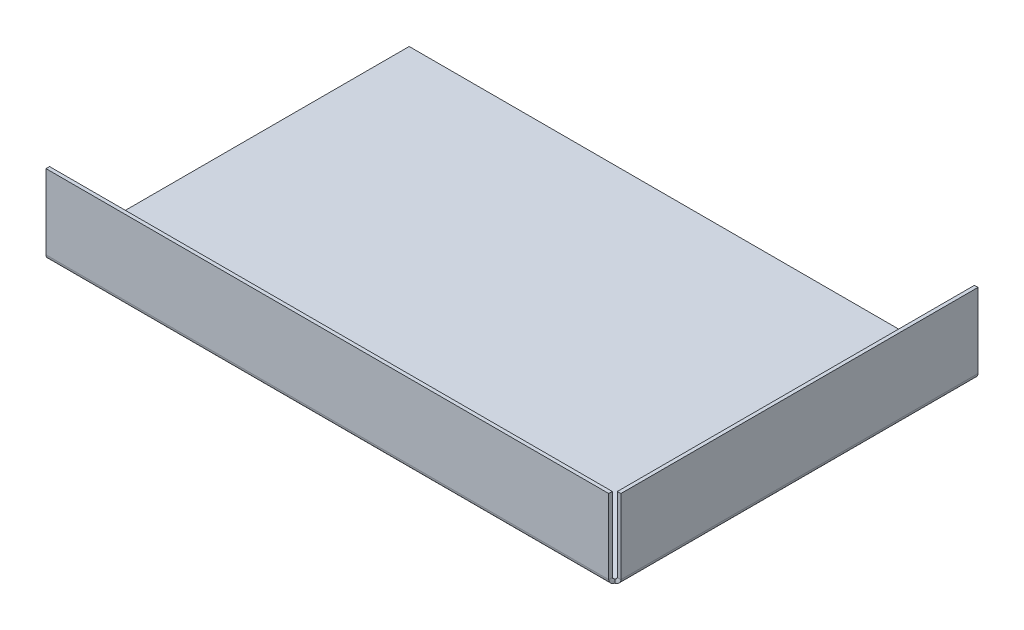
ISO-10303-21;
HEADER;
FILE_DESCRIPTION(('STEP AP214'),'2;1');
FILE_NAME('part.step','',(''),(''),'','','');
FILE_SCHEMA(('AUTOMOTIVE_DESIGN { 1 0 10303 214 1 1 1 1 }'));
ENDSEC;
DATA;
#1=APPLICATION_CONTEXT('core data for automotive mechanical design processes');
#2=APPLICATION_PROTOCOL_DEFINITION('international standard','automotive_design',2000,#1);
#3=PRODUCT_CONTEXT('',#1,'mechanical');
#4=PRODUCT('Part','Part','',(#3));
#5=PRODUCT_RELATED_PRODUCT_CATEGORY('part','',(#4));
#6=PRODUCT_DEFINITION_FORMATION('','',#4);
#7=PRODUCT_DEFINITION_CONTEXT('part definition',#1,'design');
#8=PRODUCT_DEFINITION('design','',#6,#7);
#9=PRODUCT_DEFINITION_SHAPE('','',#8);
#10=(LENGTH_UNIT() NAMED_UNIT(*) SI_UNIT(.MILLI.,.METRE.));
#11=(NAMED_UNIT(*) PLANE_ANGLE_UNIT() SI_UNIT($,.RADIAN.));
#12=(NAMED_UNIT(*) SI_UNIT($,.STERADIAN.) SOLID_ANGLE_UNIT());
#13=UNCERTAINTY_MEASURE_WITH_UNIT(LENGTH_MEASURE(1.E-05),#10,'distance_accuracy_value','');
#14=(GEOMETRIC_REPRESENTATION_CONTEXT(3) GLOBAL_UNCERTAINTY_ASSIGNED_CONTEXT((#13)) GLOBAL_UNIT_ASSIGNED_CONTEXT((#10,
#11,#12)) REPRESENTATION_CONTEXT('',''));
#15=CARTESIAN_POINT('',(0.,0.,0.));
#16=DIRECTION('',(0.,0.,1.));
#17=DIRECTION('',(1.,0.,0.));
#18=AXIS2_PLACEMENT_3D('',#15,#16,#17);
#19=CARTESIAN_POINT('',(0.,0.762,-76.5167255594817));
#20=DIRECTION('',(1.,0.,0.));
#21=DIRECTION('',(0.,0.,-1.));
#22=AXIS2_PLACEMENT_3D('',#19,#20,#21);
#23=PLANE('',#22);
#24=DIRECTION('',(0.,0.,1.));
#25=VECTOR('',#24,1.);
#26=CARTESIAN_POINT('',(0.,0.,-76.5167255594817));
#27=LINE('',#26,#25);
#28=CARTESIAN_POINT('',(0.,0.,-76.5167255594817));
#29=VERTEX_POINT('',#28);
#30=CARTESIAN_POINT('',(0.,0.,0.));
#31=VERTEX_POINT('',#30);
#32=EDGE_CURVE('E208',#29,#31,#27,.T.);
#33=ORIENTED_EDGE('',*,*,#32,.T.);
#34=DIRECTION('',(0.,-1.,0.));
#35=VECTOR('',#34,1.);
#36=CARTESIAN_POINT('',(0.,0.762,0.));
#37=LINE('',#36,#35);
#38=CARTESIAN_POINT('',(0.,0.762,0.));
#39=VERTEX_POINT('',#38);
#40=EDGE_CURVE('E11',#39,#31,#37,.T.);
#41=ORIENTED_EDGE('',*,*,#40,.F.);
#42=DIRECTION('',(0.,0.,1.));
#43=VECTOR('',#42,1.);
#44=CARTESIAN_POINT('',(0.,0.762,-76.5167255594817));
#45=LINE('',#44,#43);
#46=CARTESIAN_POINT('',(0.,0.762,-76.5167255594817));
#47=VERTEX_POINT('',#46);
#48=EDGE_CURVE('E221',#47,#39,#45,.T.);
#49=ORIENTED_EDGE('',*,*,#48,.F.);
#50=DIRECTION('',(0.,-1.,0.));
#51=VECTOR('',#50,1.);
#52=CARTESIAN_POINT('',(0.,0.762,-76.5167255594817));
#53=LINE('',#52,#51);
#54=EDGE_CURVE('E227',#47,#29,#53,.T.);
#55=ORIENTED_EDGE('',*,*,#54,.T.);
#56=EDGE_LOOP('',(#33,#41,#49,#55));
#57=FACE_BOUND('',#56,.T.);
#58=ADVANCED_FACE('F28',(#57),#23,.F.);
#59=CARTESIAN_POINT('',(0.,0.762,-76.5167255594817));
#60=DIRECTION('',(0.,0.,1.));
#61=DIRECTION('',(1.,0.,0.));
#62=AXIS2_PLACEMENT_3D('',#59,#60,#61);
#63=PLANE('',#62);
#64=DIRECTION('',(-1.,0.,0.));
#65=VECTOR('',#64,1.);
#66=CARTESIAN_POINT('',(0.,0.,-76.5167255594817));
#67=LINE('',#66,#65);
#68=CARTESIAN_POINT('',(120.423583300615,0.,-76.5167255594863));
#69=VERTEX_POINT('',#68);
#70=EDGE_CURVE('E219',#69,#29,#67,.T.);
#71=ORIENTED_EDGE('',*,*,#70,.T.);
#72=ORIENTED_EDGE('',*,*,#54,.F.);
#73=DIRECTION('',(-1.,0.,0.));
#74=VECTOR('',#73,1.);
#75=CARTESIAN_POINT('',(0.,0.762,-76.5167255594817));
#76=LINE('',#75,#74);
#77=CARTESIAN_POINT('',(120.423583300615,0.762,-76.5167255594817));
#78=VERTEX_POINT('',#77);
#79=EDGE_CURVE('E42',#78,#47,#76,.T.);
#80=ORIENTED_EDGE('',*,*,#79,.F.);
#81=DIRECTION('',(0.,-1.,0.));
#82=VECTOR('',#81,1.);
#83=CARTESIAN_POINT('',(120.423583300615,0.762,-76.5167255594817));
#84=LINE('',#83,#82);
#85=EDGE_CURVE('E230',#78,#69,#84,.T.);
#86=ORIENTED_EDGE('',*,*,#85,.T.);
#87=EDGE_LOOP('',(#71,#72,#80,#86));
#88=FACE_BOUND('',#87,.T.);
#89=ADVANCED_FACE('F265',(#88),#63,.F.);
#90=CARTESIAN_POINT('',(0.,0.762,0.));
#91=DIRECTION('',(0.,1.,0.));
#92=DIRECTION('',(0.,0.,1.));
#93=AXIS2_PLACEMENT_3D('',#90,#91,#92);
#94=PLANE('',#93);
#95=ORIENTED_EDGE('',*,*,#48,.T.);
#96=DIRECTION('',(1.,0.,0.));
#97=VECTOR('',#96,1.);
#98=CARTESIAN_POINT('',(0.,0.762,0.));
#99=LINE('',#98,#97);
#100=CARTESIAN_POINT('',(120.423583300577,0.762,0.));
#101=VERTEX_POINT('',#100);
#102=EDGE_CURVE('E223',#39,#101,#99,.T.);
#103=ORIENTED_EDGE('',*,*,#102,.T.);
#104=DIRECTION('',(0.,0.,-1.));
#105=VECTOR('',#104,1.);
#106=CARTESIAN_POINT('',(120.423583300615,0.762,-76.5167255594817));
#107=LINE('',#106,#105);
#108=EDGE_CURVE('E47',#101,#78,#107,.T.);
#109=ORIENTED_EDGE('',*,*,#108,.T.);
#110=ORIENTED_EDGE('',*,*,#79,.T.);
#111=EDGE_LOOP('',(#95,#103,#109,#110));
#112=FACE_BOUND('',#111,.T.);
#113=ADVANCED_FACE('F269',(#112),#94,.T.);
#114=CARTESIAN_POINT('',(0.,0.,0.));
#115=DIRECTION('',(0.,1.,0.));
#116=DIRECTION('',(0.,0.,1.));
#117=AXIS2_PLACEMENT_3D('',#114,#115,#116);
#118=PLANE('',#117);
#119=ORIENTED_EDGE('',*,*,#32,.F.);
#120=ORIENTED_EDGE('',*,*,#70,.F.);
#121=DIRECTION('',(0.,0.,-1.));
#122=VECTOR('',#121,1.);
#123=CARTESIAN_POINT('',(120.423583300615,0.,-76.5167255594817));
#124=LINE('',#123,#122);
#125=CARTESIAN_POINT('',(120.423583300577,0.,0.));
#126=VERTEX_POINT('',#125);
#127=EDGE_CURVE('E216',#126,#69,#124,.T.);
#128=ORIENTED_EDGE('',*,*,#127,.F.);
#129=DIRECTION('',(1.,0.,0.));
#130=VECTOR('',#129,1.);
#131=CARTESIAN_POINT('',(0.,0.,0.));
#132=LINE('',#131,#130);
#133=EDGE_CURVE('E213',#31,#126,#132,.T.);
#134=ORIENTED_EDGE('',*,*,#133,.F.);
#135=EDGE_LOOP('',(#119,#120,#128,#134));
#136=FACE_BOUND('',#135,.T.);
#137=ADVANCED_FACE('F246',(#136),#118,.F.);
#138=CARTESIAN_POINT('',(120.677583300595,16.9447415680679,-76.5167255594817));
#139=DIRECTION('',(1.23489671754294E-12,-1.,0.));
#140=DIRECTION('',(0.,0.,1.));
#141=AXIS2_PLACEMENT_3D('',#138,#139,#140);
#142=PLANE('',#141);
#143=DIRECTION('',(-1.,-1.23489671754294E-12,0.));
#144=VECTOR('',#143,1.);
#145=CARTESIAN_POINT('',(120.677583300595,16.9447415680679,-0.284815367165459));
#146=LINE('',#145,#144);
#147=CARTESIAN_POINT('',(120.677583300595,16.9447415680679,-0.284815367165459));
#148=VERTEX_POINT('',#147);
#149=CARTESIAN_POINT('',(121.439583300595,16.9447415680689,-0.284815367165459));
#150=VERTEX_POINT('',#149);
#151=EDGE_CURVE('E205',#148,#150,#146,.F.);
#152=ORIENTED_EDGE('',*,*,#151,.T.);
#153=DIRECTION('',(0.,0.,1.));
#154=VECTOR('',#153,1.);
#155=CARTESIAN_POINT('',(121.439583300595,16.9447415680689,-76.5167255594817));
#156=LINE('',#155,#154);
#157=CARTESIAN_POINT('',(121.439583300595,16.9447415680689,-76.5167255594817));
#158=VERTEX_POINT('',#157);
#159=EDGE_CURVE('E187',#158,#150,#156,.T.);
#160=ORIENTED_EDGE('',*,*,#159,.F.);
#161=DIRECTION('',(-1.,-1.23489671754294E-12,0.));
#162=VECTOR('',#161,1.);
#163=CARTESIAN_POINT('',(120.677583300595,16.9447415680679,-76.5167255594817));
#164=LINE('',#163,#162);
#165=CARTESIAN_POINT('',(120.677583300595,16.9447415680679,-76.5167255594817));
#166=VERTEX_POINT('',#165);
#167=EDGE_CURVE('E202',#166,#158,#164,.F.);
#168=ORIENTED_EDGE('',*,*,#167,.F.);
#169=DIRECTION('',(0.,0.,1.));
#170=VECTOR('',#169,1.);
#171=CARTESIAN_POINT('',(120.677583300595,16.9447415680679,-76.5167255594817));
#172=LINE('',#171,#170);
#173=EDGE_CURVE('E176',#166,#148,#172,.T.);
#174=ORIENTED_EDGE('',*,*,#173,.T.);
#175=EDGE_LOOP('',(#152,#160,#168,#174));
#176=FACE_BOUND('',#175,.T.);
#177=ADVANCED_FACE('F306',(#176),#142,.F.);
#178=CARTESIAN_POINT('',(120.677583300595,16.9447415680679,-76.5167255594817));
#179=DIRECTION('',(0.,0.,-1.));
#180=DIRECTION('',(1.23489671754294E-12,-1.,0.));
#181=AXIS2_PLACEMENT_3D('',#178,#179,#180);
#182=PLANE('',#181);
#183=ORIENTED_EDGE('',*,*,#167,.T.);
#184=DIRECTION('',(1.23489671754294E-12,-1.,0.));
#185=VECTOR('',#184,1.);
#186=CARTESIAN_POINT('',(121.439583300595,16.9447415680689,-76.5167255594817));
#187=LINE('',#186,#185);
#188=CARTESIAN_POINT('',(121.439583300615,1.01600000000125,-76.5167255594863));
#189=VERTEX_POINT('',#188);
#190=EDGE_CURVE('E192',#158,#189,#187,.T.);
#191=ORIENTED_EDGE('',*,*,#190,.T.);
#192=DIRECTION('',(-1.,-1.23489671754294E-12,0.));
#193=VECTOR('',#192,1.);
#194=CARTESIAN_POINT('',(120.677583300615,1.01600000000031,-76.516725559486));
#195=LINE('',#194,#193);
#196=CARTESIAN_POINT('',(120.677583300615,1.01600000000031,-76.5167255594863));
#197=VERTEX_POINT('',#196);
#198=EDGE_CURVE('E199',#197,#189,#195,.F.);
#199=ORIENTED_EDGE('',*,*,#198,.F.);
#200=DIRECTION('',(1.23489671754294E-12,-1.,0.));
#201=VECTOR('',#200,1.);
#202=CARTESIAN_POINT('',(120.677583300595,16.9447415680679,-76.5167255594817));
#203=LINE('',#202,#201);
#204=EDGE_CURVE('E181',#166,#197,#203,.T.);
#205=ORIENTED_EDGE('',*,*,#204,.F.);
#206=EDGE_LOOP('',(#183,#191,#199,#205));
#207=FACE_BOUND('',#206,.T.);
#208=ADVANCED_FACE('F309',(#207),#182,.T.);
#209=CARTESIAN_POINT('',(120.677583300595,16.9447415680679,-0.284815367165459));
#210=DIRECTION('',(0.,0.,-1.));
#211=DIRECTION('',(1.23489671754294E-12,-1.,0.));
#212=AXIS2_PLACEMENT_3D('',#209,#210,#211);
#213=PLANE('',#212);
#214=DIRECTION('',(1.23489671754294E-12,-1.,0.));
#215=VECTOR('',#214,1.);
#216=CARTESIAN_POINT('',(120.677583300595,16.9447415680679,-0.284815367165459));
#217=LINE('',#216,#215);
#218=CARTESIAN_POINT('',(120.677583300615,1.01600000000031,-0.284815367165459));
#219=VERTEX_POINT('',#218);
#220=EDGE_CURVE('E180',#219,#148,#217,.F.);
#221=ORIENTED_EDGE('',*,*,#220,.F.);
#222=DIRECTION('',(-1.,-1.23489671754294E-12,0.));
#223=VECTOR('',#222,1.);
#224=CARTESIAN_POINT('',(120.677583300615,1.01600000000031,-0.284815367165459));
#225=LINE('',#224,#223);
#226=CARTESIAN_POINT('',(121.439583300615,1.01600000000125,-0.284815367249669));
#227=VERTEX_POINT('',#226);
#228=EDGE_CURVE('E198',#219,#227,#225,.F.);
#229=ORIENTED_EDGE('',*,*,#228,.T.);
#230=DIRECTION('',(1.23489671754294E-12,-1.,0.));
#231=VECTOR('',#230,1.);
#232=CARTESIAN_POINT('',(121.439583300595,16.9447415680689,-0.284815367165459));
#233=LINE('',#232,#231);
#234=EDGE_CURVE('E191',#227,#150,#233,.F.);
#235=ORIENTED_EDGE('',*,*,#234,.T.);
#236=ORIENTED_EDGE('',*,*,#151,.F.);
#237=EDGE_LOOP('',(#221,#229,#235,#236));
#238=FACE_BOUND('',#237,.T.);
#239=ADVANCED_FACE('F257',(#238),#213,.F.);
#240=CARTESIAN_POINT('',(121.439583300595,16.9447415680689,-76.5167255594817));
#241=DIRECTION('',(-1.,-1.23489671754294E-12,0.));
#242=DIRECTION('',(1.23489671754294E-12,-1.,0.));
#243=AXIS2_PLACEMENT_3D('',#240,#241,#242);
#244=PLANE('',#243);
#245=DIRECTION('',(0.,0.,1.));
#246=VECTOR('',#245,1.);
#247=CARTESIAN_POINT('',(121.439583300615,1.01600000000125,-76.5167255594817));
#248=LINE('',#247,#246);
#249=EDGE_CURVE('E188',#189,#227,#248,.T.);
#250=ORIENTED_EDGE('',*,*,#249,.F.);
#251=ORIENTED_EDGE('',*,*,#190,.F.);
#252=ORIENTED_EDGE('',*,*,#159,.T.);
#253=ORIENTED_EDGE('',*,*,#234,.F.);
#254=EDGE_LOOP('',(#250,#251,#252,#253));
#255=FACE_BOUND('',#254,.T.);
#256=ADVANCED_FACE('F252',(#255),#244,.F.);
#257=CARTESIAN_POINT('',(120.677583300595,16.9447415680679,-76.5167255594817));
#258=DIRECTION('',(-1.,-1.23489671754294E-12,0.));
#259=DIRECTION('',(1.23489671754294E-12,-1.,0.));
#260=AXIS2_PLACEMENT_3D('',#257,#258,#259);
#261=PLANE('',#260);
#262=DIRECTION('',(0.,0.,1.));
#263=VECTOR('',#262,1.);
#264=CARTESIAN_POINT('',(120.677583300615,1.01600000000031,-76.5167255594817));
#265=LINE('',#264,#263);
#266=EDGE_CURVE('E177',#197,#219,#265,.T.);
#267=ORIENTED_EDGE('',*,*,#266,.T.);
#268=ORIENTED_EDGE('',*,*,#220,.T.);
#269=ORIENTED_EDGE('',*,*,#173,.F.);
#270=ORIENTED_EDGE('',*,*,#204,.T.);
#271=EDGE_LOOP('',(#267,#268,#269,#270));
#272=FACE_BOUND('',#271,.T.);
#273=ADVANCED_FACE('F318',(#272),#261,.T.);
#274=CARTESIAN_POINT('',(120.423583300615,1.016,-76.5167255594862));
#275=DIRECTION('',(-2.73267207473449E-13,0.,1.));
#276=DIRECTION('',(1.,0.,2.73267207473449E-13));
#277=AXIS2_PLACEMENT_3D('',#274,#275,#276);
#278=PLANE('',#277);
#279=ORIENTED_EDGE('',*,*,#198,.T.);
#280=CARTESIAN_POINT('',(120.423583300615,1.016,-76.5167255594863));
#281=DIRECTION('',(0.,0.,1.));
#282=DIRECTION('',(1.,0.,0.));
#283=AXIS2_PLACEMENT_3D('',#280,#281,#282);
#284=CIRCLE('',#283,1.016);
#285=EDGE_CURVE('E171',#189,#69,#284,.F.);
#286=ORIENTED_EDGE('',*,*,#285,.T.);
#287=ORIENTED_EDGE('',*,*,#85,.F.);
#288=CARTESIAN_POINT('',(120.423583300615,1.016,-76.5167255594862));
#289=DIRECTION('',(2.73267207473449E-13,0.,-1.));
#290=DIRECTION('',(-1.,0.,-2.73267207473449E-13));
#291=AXIS2_PLACEMENT_3D('',#288,#289,#290);
#292=CIRCLE('',#291,0.254);
#293=EDGE_CURVE('E165',#197,#78,#292,.T.);
#294=ORIENTED_EDGE('',*,*,#293,.F.);
#295=EDGE_LOOP('',(#279,#286,#287,#294));
#296=FACE_BOUND('',#295,.T.);
#297=ADVANCED_FACE('F263',(#296),#278,.F.);
#298=CARTESIAN_POINT('',(120.169583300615,1.016,0.284815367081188));
#299=CARTESIAN_POINT('',(119.915583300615,1.016,0.284815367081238));
#300=CARTESIAN_POINT('',(119.661583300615,1.016,0.284815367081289));
#301=CARTESIAN_POINT('',(119.407583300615,1.016,0.28481536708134));
#302=CARTESIAN_POINT('',(120.169583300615,0.508,0.284815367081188));
#303=CARTESIAN_POINT('',(119.915583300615,0.,0.284815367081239));
#304=CARTESIAN_POINT('',(119.661583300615,-0.508,0.284815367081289));
#305=CARTESIAN_POINT('',(119.407583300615,-1.016,0.28481536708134));
#306=CARTESIAN_POINT('',(120.677583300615,0.508,-0.28481536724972));
#307=CARTESIAN_POINT('',(120.931583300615,0.,-0.28481536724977));
#308=CARTESIAN_POINT('',(121.185583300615,-0.508,-0.284815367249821));
#309=CARTESIAN_POINT('',(121.439583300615,-1.016,-0.284815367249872));
#310=CARTESIAN_POINT('',(120.677583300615,1.016,-0.28481536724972));
#311=CARTESIAN_POINT('',(120.931583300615,1.016,-0.28481536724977));
#312=CARTESIAN_POINT('',(121.185583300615,1.016,-0.284815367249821));
#313=CARTESIAN_POINT('',(121.439583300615,1.016,-0.284815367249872));
#314=CARTESIAN_POINT('',(120.677583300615,1.524,-0.28481536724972));
#315=CARTESIAN_POINT('',(120.931583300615,2.032,-0.28481536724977));
#316=CARTESIAN_POINT('',(121.185583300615,2.54,-0.284815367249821));
#317=CARTESIAN_POINT('',(121.439583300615,3.048,-0.284815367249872));
#318=CARTESIAN_POINT('',(120.169583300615,1.524,0.284815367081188));
#319=CARTESIAN_POINT('',(119.915583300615,2.032,0.284815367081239));
#320=CARTESIAN_POINT('',(119.661583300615,2.54,0.284815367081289));
#321=CARTESIAN_POINT('',(119.407583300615,3.048,0.28481536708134));
#322=CARTESIAN_POINT('',(120.169583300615,1.016,0.284815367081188));
#323=CARTESIAN_POINT('',(119.915583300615,1.016,0.284815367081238));
#324=CARTESIAN_POINT('',(119.661583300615,1.016,0.284815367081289));
#325=CARTESIAN_POINT('',(119.407583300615,1.016,0.28481536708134));
#326=(BOUNDED_SURFACE() B_SPLINE_SURFACE(3,3,((#298,#299,#300,#301),(#302,#303,#304,#305),(#306,
#307,#308,#309),(#310,#311,#312,#313),(#314,#315,#316,#317),(#318,#319,#320,#321),(#322,#323,
#324,#325)),.UNSPECIFIED.,.T.,.F.,.F.) B_SPLINE_SURFACE_WITH_KNOTS((4,3,4),(4,4),(0.,0.5,1.),
(0.,1.),.UNSPECIFIED.) GEOMETRIC_REPRESENTATION_ITEM() RATIONAL_B_SPLINE_SURFACE(((1.,1.,1.,1.),
(0.333333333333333,0.333333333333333,0.333333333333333,0.333333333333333),(0.333333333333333,
0.333333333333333,0.333333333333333,0.333333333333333),(1.,1.,1.,1.),(0.333333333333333,
0.333333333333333,0.333333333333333,0.333333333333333),(0.333333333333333,0.333333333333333,
0.333333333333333,0.333333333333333),(1.,1.,1.,1.))) REPRESENTATION_ITEM('') SURFACE());
#327=CARTESIAN_POINT('',(120.423583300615,1.016,-8.42659275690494E-11));
#328=DIRECTION('',(0.746327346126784,0.,0.665579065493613));
#329=DIRECTION('',(-0.665579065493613,0.,0.746327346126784));
#330=AXIS2_PLACEMENT_3D('',#327,#328,#329);
#331=ELLIPSE('',#330,0.381622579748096,0.254);
#332=EDGE_CURVE('E168',#101,#219,#331,.T.);
#333=DIRECTION('',(0.,-1.,0.));
#334=VECTOR('',#333,1.);
#335=CARTESIAN_POINT('',(120.423583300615,0.762,0.));
#336=LINE('',#335,#334);
#337=EDGE_CURVE('E35',#101,#126,#336,.T.);
#338=CARTESIAN_POINT('',(120.423583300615,1.016,-8.42659275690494E-11));
#339=DIRECTION('',(0.269924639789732,0.,0.962881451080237));
#340=DIRECTION('',(-0.962881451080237,0.,0.269924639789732));
#341=AXIS2_PLACEMENT_3D('',#338,#339,#340);
#342=ELLIPSE('',#341,1.05516623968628,1.016);
#343=EDGE_CURVE('E174',#126,#227,#342,.T.);
#344=ORIENTED_EDGE('',*,*,#332,.F.);
#345=ORIENTED_EDGE('',*,*,#337,.T.);
#346=ORIENTED_EDGE('',*,*,#343,.T.);
#347=ORIENTED_EDGE('',*,*,#228,.F.);
#348=EDGE_LOOP('',(#344,#345,#346,#347));
#349=FACE_BOUND('',#348,.T.);
#350=ADVANCED_FACE('F235',(#349),#326,.F.);
#351=CARTESIAN_POINT('',(120.423583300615,1.016,-678.634642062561));
#352=DIRECTION('',(0.,0.,1.));
#353=DIRECTION('',(1.,0.,0.));
#354=AXIS2_PLACEMENT_3D('',#351,#352,#353);
#355=CYLINDRICAL_SURFACE('',#354,1.016);
#356=ORIENTED_EDGE('',*,*,#127,.T.);
#357=ORIENTED_EDGE('',*,*,#285,.F.);
#358=ORIENTED_EDGE('',*,*,#249,.T.);
#359=ORIENTED_EDGE('',*,*,#343,.F.);
#360=EDGE_LOOP('',(#356,#357,#358,#359));
#361=FACE_BOUND('',#360,.T.);
#362=ADVANCED_FACE('F248',(#361),#355,.T.);
#363=CARTESIAN_POINT('',(120.423583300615,1.016,-678.634642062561));
#364=DIRECTION('',(0.,0.,1.));
#365=DIRECTION('',(1.,0.,0.));
#366=AXIS2_PLACEMENT_3D('',#363,#364,#365);
#367=CYLINDRICAL_SURFACE('',#366,0.254);
#368=ORIENTED_EDGE('',*,*,#108,.F.);
#369=ORIENTED_EDGE('',*,*,#332,.T.);
#370=ORIENTED_EDGE('',*,*,#266,.F.);
#371=ORIENTED_EDGE('',*,*,#293,.T.);
#372=EDGE_LOOP('',(#368,#369,#370,#371));
#373=FACE_BOUND('',#372,.T.);
#374=ADVANCED_FACE('F260',(#373),#367,.F.);
#375=CARTESIAN_POINT('',(0.,16.9447415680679,0.253999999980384));
#376=DIRECTION('',(1.,0.,0.));
#377=DIRECTION('',(0.,-1.,1.23489671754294E-12));
#378=AXIS2_PLACEMENT_3D('',#375,#376,#377);
#379=PLANE('',#378);
#380=DIRECTION('',(0.,-1.23489671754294E-12,-1.));
#381=VECTOR('',#380,1.);
#382=CARTESIAN_POINT('',(0.,1.01600000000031,0.254000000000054));
#383=LINE('',#382,#381);
#384=CARTESIAN_POINT('',(0.,1.01600000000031,0.254000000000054));
#385=VERTEX_POINT('',#384);
#386=CARTESIAN_POINT('',(0.,1.01600000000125,1.01600000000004));
#387=VERTEX_POINT('',#386);
#388=EDGE_CURVE('E279',#385,#387,#383,.F.);
#389=ORIENTED_EDGE('',*,*,#388,.T.);
#390=DIRECTION('',(0.,-1.,1.23489671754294E-12));
#391=VECTOR('',#390,1.);
#392=CARTESIAN_POINT('',(0.,16.9447415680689,1.01599999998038));
#393=LINE('',#392,#391);
#394=CARTESIAN_POINT('',(0.,16.9447415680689,1.01599999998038));
#395=VERTEX_POINT('',#394);
#396=EDGE_CURVE('E145',#387,#395,#393,.F.);
#397=ORIENTED_EDGE('',*,*,#396,.T.);
#398=DIRECTION('',(0.,-1.23489671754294E-12,-1.));
#399=VECTOR('',#398,1.);
#400=CARTESIAN_POINT('',(0.,16.9447415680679,0.253999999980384));
#401=LINE('',#400,#399);
#402=CARTESIAN_POINT('',(0.,16.9447415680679,0.253999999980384));
#403=VERTEX_POINT('',#402);
#404=EDGE_CURVE('E139',#403,#395,#401,.F.);
#405=ORIENTED_EDGE('',*,*,#404,.F.);
#406=DIRECTION('',(0.,-1.,1.23489671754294E-12));
#407=VECTOR('',#406,1.);
#408=CARTESIAN_POINT('',(0.,16.9447415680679,0.253999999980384));
#409=LINE('',#408,#407);
#410=EDGE_CURVE('E150',#385,#403,#409,.F.);
#411=ORIENTED_EDGE('',*,*,#410,.F.);
#412=EDGE_LOOP('',(#389,#397,#405,#411));
#413=FACE_BOUND('',#412,.T.);
#414=ADVANCED_FACE('F283',(#413),#379,.F.);
#415=CARTESIAN_POINT('',(722.54149980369,16.9447415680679,0.25399999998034));
#416=DIRECTION('',(0.,-1.,1.23489671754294E-12));
#417=DIRECTION('',(-1.,0.,0.));
#418=AXIS2_PLACEMENT_3D('',#415,#416,#417);
#419=PLANE('',#418);
#420=ORIENTED_EDGE('',*,*,#404,.T.);
#421=DIRECTION('',(-1.,0.,0.));
#422=VECTOR('',#421,1.);
#423=CARTESIAN_POINT('',(722.54149980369,16.9447415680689,1.01599999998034));
#424=LINE('',#423,#422);
#425=CARTESIAN_POINT('',(120.138767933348,16.9447415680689,1.01599999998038));
#426=VERTEX_POINT('',#425);
#427=EDGE_CURVE('E121',#426,#395,#424,.T.);
#428=ORIENTED_EDGE('',*,*,#427,.F.);
#429=DIRECTION('',(0.,-1.23489671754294E-12,-1.));
#430=VECTOR('',#429,1.);
#431=CARTESIAN_POINT('',(120.138767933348,16.9447415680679,0.253999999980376));
#432=LINE('',#431,#430);
#433=CARTESIAN_POINT('',(120.138767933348,16.9447415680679,0.253999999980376));
#434=VERTEX_POINT('',#433);
#435=EDGE_CURVE('E127',#434,#426,#432,.F.);
#436=ORIENTED_EDGE('',*,*,#435,.F.);
#437=DIRECTION('',(-1.,0.,0.));
#438=VECTOR('',#437,1.);
#439=CARTESIAN_POINT('',(722.54149980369,16.9447415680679,0.25399999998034));
#440=LINE('',#439,#438);
#441=EDGE_CURVE('E135',#434,#403,#440,.T.);
#442=ORIENTED_EDGE('',*,*,#441,.T.);
#443=EDGE_LOOP('',(#420,#428,#436,#442));
#444=FACE_BOUND('',#443,.T.);
#445=ADVANCED_FACE('F137',(#444),#419,.F.);
#446=CARTESIAN_POINT('',(120.138767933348,16.9447415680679,0.253999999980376));
#447=DIRECTION('',(1.,0.,0.));
#448=DIRECTION('',(0.,-1.,1.23489671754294E-12));
#449=AXIS2_PLACEMENT_3D('',#446,#447,#448);
#450=PLANE('',#449);
#451=DIRECTION('',(0.,-1.,1.23489671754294E-12));
#452=VECTOR('',#451,1.);
#453=CARTESIAN_POINT('',(120.138767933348,16.9447415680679,0.253999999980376));
#454=LINE('',#453,#452);
#455=CARTESIAN_POINT('',(120.13876793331,1.01600000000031,0.254000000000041));
#456=VERTEX_POINT('',#455);
#457=EDGE_CURVE('E132',#434,#456,#454,.T.);
#458=ORIENTED_EDGE('',*,*,#457,.F.);
#459=ORIENTED_EDGE('',*,*,#435,.T.);
#460=DIRECTION('',(0.,-1.,1.23489671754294E-12));
#461=VECTOR('',#460,1.);
#462=CARTESIAN_POINT('',(120.138767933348,16.9447415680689,1.01599999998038));
#463=LINE('',#462,#461);
#464=CARTESIAN_POINT('',(120.13876793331,1.01600000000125,1.01600000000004));
#465=VERTEX_POINT('',#464);
#466=EDGE_CURVE('E116',#426,#465,#463,.T.);
#467=ORIENTED_EDGE('',*,*,#466,.T.);
#468=DIRECTION('',(0.,-1.23489671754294E-12,-1.));
#469=VECTOR('',#468,1.);
#470=CARTESIAN_POINT('',(120.138767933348,1.01600000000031,0.254000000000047));
#471=LINE('',#470,#469);
#472=EDGE_CURVE('E153',#456,#465,#471,.F.);
#473=ORIENTED_EDGE('',*,*,#472,.F.);
#474=EDGE_LOOP('',(#458,#459,#467,#473));
#475=FACE_BOUND('',#474,.T.);
#476=ADVANCED_FACE('F130',(#475),#450,.T.);
#477=CARTESIAN_POINT('',(722.54149980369,16.9447415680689,1.01599999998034));
#478=DIRECTION('',(0.,-1.23489671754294E-12,-1.));
#479=DIRECTION('',(0.,-1.,1.23489671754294E-12));
#480=AXIS2_PLACEMENT_3D('',#477,#478,#479);
#481=PLANE('',#480);
#482=ORIENTED_EDGE('',*,*,#427,.T.);
#483=ORIENTED_EDGE('',*,*,#396,.F.);
#484=DIRECTION('',(-1.,0.,0.));
#485=VECTOR('',#484,1.);
#486=CARTESIAN_POINT('',(722.54149980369,1.01600000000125,1.01600000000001));
#487=LINE('',#486,#485);
#488=EDGE_CURVE('E124',#465,#387,#487,.T.);
#489=ORIENTED_EDGE('',*,*,#488,.F.);
#490=ORIENTED_EDGE('',*,*,#466,.F.);
#491=EDGE_LOOP('',(#482,#483,#489,#490));
#492=FACE_BOUND('',#491,.T.);
#493=ADVANCED_FACE('F118',(#492),#481,.F.);
#494=CARTESIAN_POINT('',(722.54149980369,16.9447415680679,0.25399999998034));
#495=DIRECTION('',(0.,-1.23489671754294E-12,-1.));
#496=DIRECTION('',(0.,-1.,1.23489671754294E-12));
#497=AXIS2_PLACEMENT_3D('',#494,#495,#496);
#498=PLANE('',#497);
#499=ORIENTED_EDGE('',*,*,#441,.F.);
#500=ORIENTED_EDGE('',*,*,#457,.T.);
#501=DIRECTION('',(-1.,0.,0.));
#502=VECTOR('',#501,1.);
#503=CARTESIAN_POINT('',(722.54149980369,1.01600000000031,0.25400000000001));
#504=LINE('',#503,#502);
#505=EDGE_CURVE('E142',#456,#385,#504,.T.);
#506=ORIENTED_EDGE('',*,*,#505,.T.);
#507=ORIENTED_EDGE('',*,*,#410,.T.);
#508=EDGE_LOOP('',(#499,#500,#506,#507));
#509=FACE_BOUND('',#508,.T.);
#510=ADVANCED_FACE('F276',(#509),#498,.T.);
#511=CARTESIAN_POINT('',(120.13876793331,1.016,0.254000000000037));
#512=CARTESIAN_POINT('',(120.13876793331,1.016,0.508000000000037));
#513=CARTESIAN_POINT('',(120.13876793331,1.016,0.762000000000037));
#514=CARTESIAN_POINT('',(120.13876793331,1.016,1.01600000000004));
#515=CARTESIAN_POINT('',(120.13876793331,0.508,0.254000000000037));
#516=CARTESIAN_POINT('',(120.13876793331,0.,0.508000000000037));
#517=CARTESIAN_POINT('',(120.13876793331,-0.508,0.762000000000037));
#518=CARTESIAN_POINT('',(120.13876793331,-1.016,1.01600000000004));
#519=CARTESIAN_POINT('',(120.708398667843,0.508,-0.253999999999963));
#520=CARTESIAN_POINT('',(120.708398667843,0.,-0.507999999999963));
#521=CARTESIAN_POINT('',(120.708398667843,-0.508,-0.761999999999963));
#522=CARTESIAN_POINT('',(120.708398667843,-1.016,-1.01599999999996));
#523=CARTESIAN_POINT('',(120.708398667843,1.016,-0.253999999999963));
#524=CARTESIAN_POINT('',(120.708398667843,1.016,-0.507999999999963));
#525=CARTESIAN_POINT('',(120.708398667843,1.016,-0.761999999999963));
#526=CARTESIAN_POINT('',(120.708398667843,1.016,-1.01599999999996));
#527=CARTESIAN_POINT('',(120.708398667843,1.524,-0.253999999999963));
#528=CARTESIAN_POINT('',(120.708398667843,2.032,-0.507999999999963));
#529=CARTESIAN_POINT('',(120.708398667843,2.54,-0.761999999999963));
#530=CARTESIAN_POINT('',(120.708398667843,3.048,-1.01599999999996));
#531=CARTESIAN_POINT('',(120.13876793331,1.524,0.254000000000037));
#532=CARTESIAN_POINT('',(120.13876793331,2.032,0.508000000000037));
#533=CARTESIAN_POINT('',(120.13876793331,2.54,0.762000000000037));
#534=CARTESIAN_POINT('',(120.13876793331,3.048,1.01600000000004));
#535=CARTESIAN_POINT('',(120.13876793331,1.016,0.254000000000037));
#536=CARTESIAN_POINT('',(120.13876793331,1.016,0.508000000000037));
#537=CARTESIAN_POINT('',(120.13876793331,1.016,0.762000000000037));
#538=CARTESIAN_POINT('',(120.13876793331,1.016,1.01600000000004));
#539=(BOUNDED_SURFACE() B_SPLINE_SURFACE(3,3,((#511,#512,#513,#514),(#515,#516,#517,#518),(#519,
#520,#521,#522),(#523,#524,#525,#526),(#527,#528,#529,#530),(#531,#532,#533,#534),(#535,#536,
#537,#538)),.UNSPECIFIED.,.T.,.F.,.F.) B_SPLINE_SURFACE_WITH_KNOTS((4,3,4),(4,4),(0.,0.5,1.),
(0.,1.),.UNSPECIFIED.) GEOMETRIC_REPRESENTATION_ITEM() RATIONAL_B_SPLINE_SURFACE(((1.,1.,1.,1.),
(0.333333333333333,0.333333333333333,0.333333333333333,0.333333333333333),(0.333333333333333,
0.333333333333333,0.333333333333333,0.333333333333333),(1.,1.,1.,1.),(0.333333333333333,
0.333333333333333,0.333333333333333,0.333333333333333),(0.333333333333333,0.333333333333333,
0.333333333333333,0.333333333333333),(1.,1.,1.,1.))) REPRESENTATION_ITEM('') SURFACE());
#540=CARTESIAN_POINT('',(120.423583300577,1.016,0.));
#541=DIRECTION('',(0.962881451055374,0.,0.269924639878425));
#542=DIRECTION('',(-0.269924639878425,0.,0.962881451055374));
#543=AXIS2_PLACEMENT_3D('',#540,#541,#542);
#544=ELLIPSE('',#543,1.05516623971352,1.016);
#545=EDGE_CURVE('E157',#465,#126,#544,.T.);
#546=CARTESIAN_POINT('',(120.423583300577,1.016,0.));
#547=DIRECTION('',(0.665579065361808,0.,0.746327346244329));
#548=DIRECTION('',(-0.746327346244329,0.,0.665579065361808));
#549=AXIS2_PLACEMENT_3D('',#546,#547,#548);
#550=ELLIPSE('',#549,0.38162257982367,0.254);
#551=EDGE_CURVE('E163',#456,#101,#550,.T.);
#552=ORIENTED_EDGE('',*,*,#472,.T.);
#553=ORIENTED_EDGE('',*,*,#545,.T.);
#554=ORIENTED_EDGE('',*,*,#337,.F.);
#555=ORIENTED_EDGE('',*,*,#551,.F.);
#556=EDGE_LOOP('',(#552,#553,#554,#555));
#557=FACE_BOUND('',#556,.T.);
#558=ADVANCED_FACE('F245',(#557),#539,.F.);
#559=CARTESIAN_POINT('',(0.,1.016,0.));
#560=DIRECTION('',(1.,0.,0.));
#561=DIRECTION('',(0.,0.,-1.));
#562=AXIS2_PLACEMENT_3D('',#559,#560,#561);
#563=PLANE('',#562);
#564=CARTESIAN_POINT('',(0.,1.016,0.));
#565=DIRECTION('',(-1.,0.,0.));
#566=DIRECTION('',(0.,0.,1.));
#567=AXIS2_PLACEMENT_3D('',#564,#565,#566);
#568=CIRCLE('',#567,0.254);
#569=EDGE_CURVE('E160',#39,#385,#568,.T.);
#570=ORIENTED_EDGE('',*,*,#569,.F.);
#571=ORIENTED_EDGE('',*,*,#40,.T.);
#572=CARTESIAN_POINT('',(0.,1.016,0.));
#573=DIRECTION('',(-1.,0.,0.));
#574=DIRECTION('',(0.,0.,1.));
#575=AXIS2_PLACEMENT_3D('',#572,#573,#574);
#576=CIRCLE('',#575,1.016);
#577=EDGE_CURVE('E155',#31,#387,#576,.T.);
#578=ORIENTED_EDGE('',*,*,#577,.T.);
#579=ORIENTED_EDGE('',*,*,#388,.F.);
#580=EDGE_LOOP('',(#570,#571,#578,#579));
#581=FACE_BOUND('',#580,.T.);
#582=ADVANCED_FACE('F285',(#581),#563,.F.);
#583=CARTESIAN_POINT('',(722.541499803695,1.016,0.));
#584=DIRECTION('',(-1.,0.,0.));
#585=DIRECTION('',(0.,0.,1.));
#586=AXIS2_PLACEMENT_3D('',#583,#584,#585);
#587=CYLINDRICAL_SURFACE('',#586,1.016);
#588=ORIENTED_EDGE('',*,*,#133,.T.);
#589=ORIENTED_EDGE('',*,*,#545,.F.);
#590=ORIENTED_EDGE('',*,*,#488,.T.);
#591=ORIENTED_EDGE('',*,*,#577,.F.);
#592=EDGE_LOOP('',(#588,#589,#590,#591));
#593=FACE_BOUND('',#592,.T.);
#594=ADVANCED_FACE('F240',(#593),#587,.T.);
#595=CARTESIAN_POINT('',(722.541499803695,1.016,0.));
#596=DIRECTION('',(-1.,0.,0.));
#597=DIRECTION('',(0.,0.,1.));
#598=AXIS2_PLACEMENT_3D('',#595,#596,#597);
#599=CYLINDRICAL_SURFACE('',#598,0.254);
#600=ORIENTED_EDGE('',*,*,#102,.F.);
#601=ORIENTED_EDGE('',*,*,#569,.T.);
#602=ORIENTED_EDGE('',*,*,#505,.F.);
#603=ORIENTED_EDGE('',*,*,#551,.T.);
#604=EDGE_LOOP('',(#600,#601,#602,#603));
#605=FACE_BOUND('',#604,.T.);
#606=ADVANCED_FACE('F272',(#605),#599,.F.);
#607=CLOSED_SHELL('',(#58,#89,#113,#137,#177,#208,#239,#256,#273,#297,#350,#362,#374,#414,#445,
#476,#493,#510,#558,#582,#594,#606));
#608=MANIFOLD_SOLID_BREP('B2',#607);
#609=ADVANCED_BREP_SHAPE_REPRESENTATION('',(#18,#608),#14);
#610=SHAPE_DEFINITION_REPRESENTATION(#9,#609);
ENDSEC;
END-ISO-10303-21;
